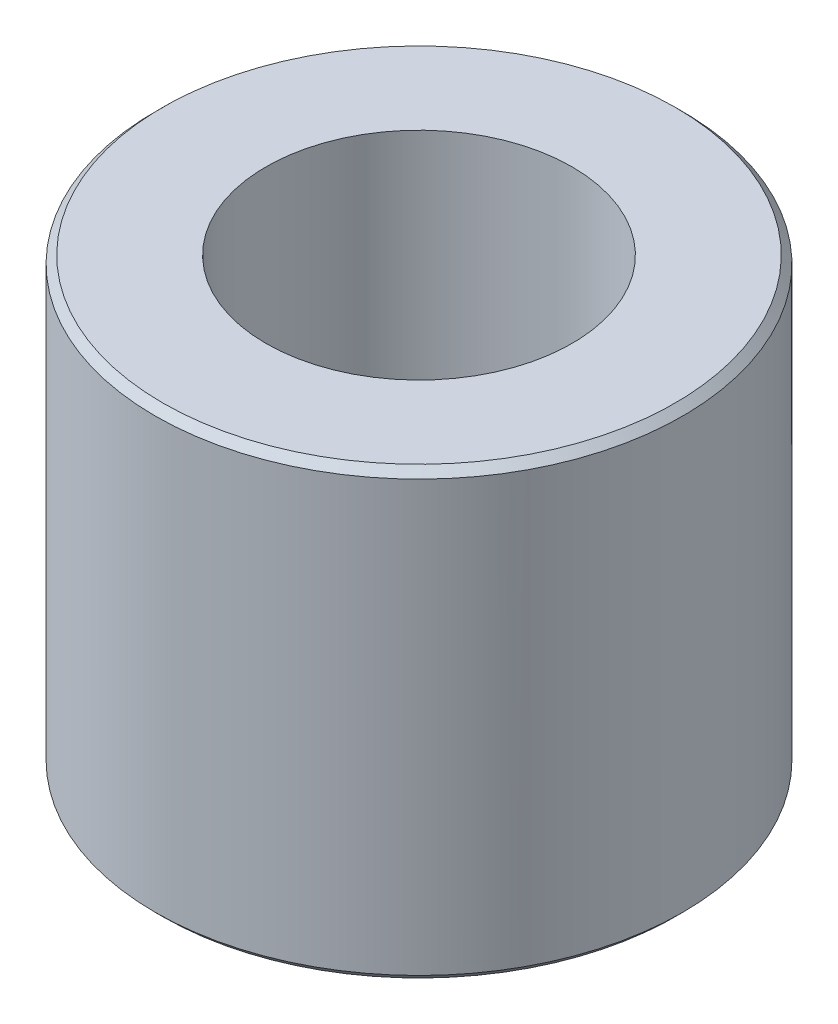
ISO-10303-21;
HEADER;
FILE_DESCRIPTION(('STEP AP214'),'2;1');
FILE_NAME('part.step','',(''),(''),'','','');
FILE_SCHEMA(('AUTOMOTIVE_DESIGN { 1 0 10303 214 1 1 1 1 }'));
ENDSEC;
DATA;
#1=APPLICATION_CONTEXT('core data for automotive mechanical design processes');
#2=APPLICATION_PROTOCOL_DEFINITION('international standard','automotive_design',2000,#1);
#3=PRODUCT_CONTEXT('',#1,'mechanical');
#4=PRODUCT('Part','Part','',(#3));
#5=PRODUCT_RELATED_PRODUCT_CATEGORY('part','',(#4));
#6=PRODUCT_DEFINITION_FORMATION('','',#4);
#7=PRODUCT_DEFINITION_CONTEXT('part definition',#1,'design');
#8=PRODUCT_DEFINITION('design','',#6,#7);
#9=PRODUCT_DEFINITION_SHAPE('','',#8);
#10=(LENGTH_UNIT() NAMED_UNIT(*) SI_UNIT(.MILLI.,.METRE.));
#11=(NAMED_UNIT(*) PLANE_ANGLE_UNIT() SI_UNIT($,.RADIAN.));
#12=(NAMED_UNIT(*) SI_UNIT($,.STERADIAN.) SOLID_ANGLE_UNIT());
#13=UNCERTAINTY_MEASURE_WITH_UNIT(LENGTH_MEASURE(1.E-05),#10,'distance_accuracy_value','');
#14=(GEOMETRIC_REPRESENTATION_CONTEXT(3) GLOBAL_UNCERTAINTY_ASSIGNED_CONTEXT((#13)) GLOBAL_UNIT_ASSIGNED_CONTEXT((#10,
#11,#12)) REPRESENTATION_CONTEXT('',''));
#15=CARTESIAN_POINT('',(0.,0.,0.));
#16=DIRECTION('',(0.,0.,1.));
#17=DIRECTION('',(1.,0.,0.));
#18=AXIS2_PLACEMENT_3D('',#15,#16,#17);
#19=CARTESIAN_POINT('',(0.,4.86357961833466,0.));
#20=DIRECTION('',(0.,1.,0.));
#21=DIRECTION('',(0.,0.,1.));
#22=AXIS2_PLACEMENT_3D('',#19,#20,#21);
#23=CYLINDRICAL_SURFACE('',#22,11.1125);
#24=CARTESIAN_POINT('',(0.,-16.0274,0.));
#25=DIRECTION('',(0.,1.,0.));
#26=DIRECTION('',(0.,0.,1.));
#27=AXIS2_PLACEMENT_3D('',#24,#25,#26);
#28=CIRCLE('',#27,11.1125);
#29=CARTESIAN_POINT('',(0.,-16.0274,11.1125));
#30=VERTEX_POINT('',#29);
#31=EDGE_CURVE('E206',#30,#30,#28,.T.);
#32=ORIENTED_EDGE('',*,*,#31,.T.);
#33=EDGE_LOOP('',(#32));
#34=FACE_BOUND('',#33,.T.);
#35=CARTESIAN_POINT('',(0.,-17.2974,0.));
#36=DIRECTION('',(0.,-1.,0.));
#37=DIRECTION('',(0.,0.,-1.));
#38=AXIS2_PLACEMENT_3D('',#35,#36,#37);
#39=CIRCLE('',#38,11.1125);
#40=CARTESIAN_POINT('',(0.,-17.2974,-11.1125));
#41=VERTEX_POINT('',#40);
#42=CARTESIAN_POINT('',(-9.62370729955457,-17.2974,-5.55625));
#43=VERTEX_POINT('',#42);
#44=EDGE_CURVE('E275',#41,#43,#39,.F.);
#45=ORIENTED_EDGE('',*,*,#44,.F.);
#46=CARTESIAN_POINT('',(9.62370729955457,-17.2974,-5.55624999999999));
#47=VERTEX_POINT('',#46);
#48=EDGE_CURVE('E53',#47,#41,#39,.F.);
#49=ORIENTED_EDGE('',*,*,#48,.F.);
#50=CARTESIAN_POINT('',(9.62370729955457,-17.2974,5.55625));
#51=VERTEX_POINT('',#50);
#52=EDGE_CURVE('E146',#51,#47,#39,.F.);
#53=ORIENTED_EDGE('',*,*,#52,.F.);
#54=CARTESIAN_POINT('',(0.,-17.2974,11.1125));
#55=VERTEX_POINT('',#54);
#56=EDGE_CURVE('E334',#55,#51,#39,.F.);
#57=ORIENTED_EDGE('',*,*,#56,.F.);
#58=CARTESIAN_POINT('',(-9.62370729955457,-17.2974,5.55624999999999));
#59=VERTEX_POINT('',#58);
#60=EDGE_CURVE('E331',#59,#55,#39,.F.);
#61=ORIENTED_EDGE('',*,*,#60,.F.);
#62=EDGE_CURVE('E328',#43,#59,#39,.F.);
#63=ORIENTED_EDGE('',*,*,#62,.F.);
#64=EDGE_LOOP('',(#45,#49,#53,#57,#61,#63));
#65=FACE_BOUND('',#64,.T.);
#66=ADVANCED_FACE('F34',(#34,#65),#23,.F.);
#67=CARTESIAN_POINT('',(0.,-29.9974,0.));
#68=DIRECTION('',(0.,-1.,0.));
#69=DIRECTION('',(0.,0.,-1.));
#70=AXIS2_PLACEMENT_3D('',#67,#68,#69);
#71=CONICAL_SURFACE('',#70,12.7635,0.785398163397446);
#72=CARTESIAN_POINT('',(6.48426541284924,-29.9976,-10.9939228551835));
#73=CARTESIAN_POINT('',(6.59253971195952,-29.8910895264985,-10.8063862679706));
#74=CARTESIAN_POINT('',(6.70165193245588,-29.787898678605,-10.6173983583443));
#75=CARTESIAN_POINT('',(6.92167256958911,-29.5891803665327,-10.2363114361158));
#76=CARTESIAN_POINT('',(7.0325818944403,-29.4936569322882,-10.0442108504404));
#77=CARTESIAN_POINT('',(7.25680524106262,-29.3109211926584,-9.65584462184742));
#78=CARTESIAN_POINT('',(7.37012898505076,-29.2237563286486,-9.45956213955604));
#79=CARTESIAN_POINT('',(7.59858968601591,-29.0595760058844,-9.0638565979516));
#80=CARTESIAN_POINT('',(7.71372637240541,-28.9825590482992,-8.86443400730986));
#81=CARTESIAN_POINT('',(7.9440420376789,-28.8410293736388,-8.46551557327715));
#82=CARTESIAN_POINT('',(8.059194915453,-28.7763477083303,-8.26606493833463));
#83=CARTESIAN_POINT('',(8.29105896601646,-28.6593600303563,-7.86446462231));
#84=CARTESIAN_POINT('',(8.4077699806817,-28.6070527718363,-7.66231521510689));
#85=CARTESIAN_POINT('',(8.64226768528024,-28.5160884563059,-7.25615327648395));
#86=CARTESIAN_POINT('',(8.76005154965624,-28.4774025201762,-7.0521456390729));
#87=CARTESIAN_POINT('',(8.99656380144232,-28.4145040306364,-6.64249440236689));
#88=CARTESIAN_POINT('',(9.11529205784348,-28.3902895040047,-6.43685102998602));
#89=CARTESIAN_POINT('',(9.40805409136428,-28.349375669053,-5.92977231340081));
#90=CARTESIAN_POINT('',(9.58240923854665,-28.3412550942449,-5.6277803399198));
#91=CARTESIAN_POINT('',(9.93076369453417,-28.3578996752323,-5.02441272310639));
#92=CARTESIAN_POINT('',(10.1047628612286,-28.3826760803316,-4.72303732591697));
#93=CARTESIAN_POINT('',(10.4510766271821,-28.4636521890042,-4.12320428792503));
#94=CARTESIAN_POINT('',(10.6233892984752,-28.5198843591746,-3.82474998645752));
#95=CARTESIAN_POINT('',(10.965036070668,-28.6607303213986,-3.23300041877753));
#96=CARTESIAN_POINT('',(11.1343704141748,-28.7453417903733,-2.93970473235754));
#97=CARTESIAN_POINT('',(11.4280771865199,-28.9151765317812,-2.43098968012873));
#98=CARTESIAN_POINT('',(11.5532320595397,-28.9950951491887,-2.21421508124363));
#99=CARTESIAN_POINT('',(11.8014107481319,-29.1671750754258,-1.78435698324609));
#100=CARTESIAN_POINT('',(11.9244346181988,-29.2593360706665,-1.57127338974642));
#101=CARTESIAN_POINT('',(12.1679537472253,-29.4539935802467,-1.14948588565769));
#102=CARTESIAN_POINT('',(12.2884557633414,-29.5564565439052,-0.940770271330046));
#103=CARTESIAN_POINT('',(12.5273499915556,-29.7705177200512,-0.526993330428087));
#104=CARTESIAN_POINT('',(12.6457431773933,-29.8821115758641,-0.321930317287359));
#105=CARTESIAN_POINT('',(12.7631491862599,-29.9976,-0.118577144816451));
#106=B_SPLINE_CURVE_WITH_KNOTS('',3,(#72,#73,#74,#75,#76,#77,#78,#79,#80,#81,#82,#83,#84,#85,
#86,#87,#88,#89,#90,#91,#92,#93,#94,#95,#96,#97,#98,#99,#100,#101,#102,#103,#104,#105),
.UNSPECIFIED.,.F.,.F.,(4,2,2,2,2,2,2,2,2,2,2,2,2,2,2,2,4),(0.,0.72400407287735,1.44838621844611,
2.17666264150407,2.90483137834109,3.62216939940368,4.3394351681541,5.05517094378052,
5.77080910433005,6.81559131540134,7.86073088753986,8.9069511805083,9.95308585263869,
10.7410355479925,11.5289650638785,12.3144068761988,13.0994760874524),.UNSPECIFIED.);
#107=CARTESIAN_POINT('',(6.48446869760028,-29.9974,-10.9935707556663));
#108=VERTEX_POINT('',#107);
#109=CARTESIAN_POINT('',(12.7629459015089,-29.9974,-0.118929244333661));
#110=VERTEX_POINT('',#109);
#111=EDGE_CURVE('E262',#108,#110,#106,.T.);
#112=ORIENTED_EDGE('',*,*,#111,.F.);
#113=CARTESIAN_POINT('',(0.,-29.9974,0.));
#114=DIRECTION('',(0.,-1.,0.));
#115=DIRECTION('',(0.,0.,-1.));
#116=AXIS2_PLACEMENT_3D('',#113,#114,#115);
#117=CIRCLE('',#116,12.7635);
#118=EDGE_CURVE('E229',#110,#108,#117,.F.);
#119=ORIENTED_EDGE('',*,*,#118,.F.);
#120=EDGE_LOOP('',(#112,#119));
#121=FACE_BOUND('',#120,.T.);
#122=ADVANCED_FACE('F316',(#121),#71,.F.);
#123=CARTESIAN_POINT('',(-13.3617774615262,-34.6127593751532,-11.1125));
#124=CARTESIAN_POINT('',(-13.0388569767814,-34.3645369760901,-11.1125));
#125=CARTESIAN_POINT('',(-12.7141934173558,-34.1185465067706,-11.1125));
#126=CARTESIAN_POINT('',(-12.0606688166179,-33.6320481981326,-11.1125));
#127=CARTESIAN_POINT('',(-11.731806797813,-33.3915416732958,-11.1125));
#128=CARTESIAN_POINT('',(-11.0667704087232,-32.9153183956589,-11.1125));
#129=CARTESIAN_POINT('',(-10.7305591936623,-32.6796529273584,-11.1125));
#130=CARTESIAN_POINT('',(-10.0525358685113,-32.2165493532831,-11.1125));
#131=CARTESIAN_POINT('',(-9.71072414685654,-31.9891106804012,-11.1125));
#132=CARTESIAN_POINT('',(-8.99877913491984,-31.5302960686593,-11.1125));
#133=CARTESIAN_POINT('',(-8.6282199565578,-31.2995776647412,-11.1125));
#134=CARTESIAN_POINT('',(-7.8784014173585,-30.852498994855,-11.1125));
#135=CARTESIAN_POINT('',(-7.49914061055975,-30.6361411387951,-11.1125));
#136=CARTESIAN_POINT('',(-6.7318213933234,-30.2223940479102,-11.1125));
#137=CARTESIAN_POINT('',(-6.34379324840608,-30.0249491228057,-11.1125));
#138=CARTESIAN_POINT('',(-5.55678484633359,-29.653451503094,-11.1125));
#139=CARTESIAN_POINT('',(-5.15780985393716,-29.4793877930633,-11.1125));
#140=CARTESIAN_POINT('',(-4.38768242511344,-29.1765435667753,-11.1125));
#141=CARTESIAN_POINT('',(-4.01762828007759,-29.0449985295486,-11.1125));
#142=CARTESIAN_POINT('',(-3.26811559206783,-28.8115314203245,-11.1125));
#143=CARTESIAN_POINT('',(-2.88865644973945,-28.7096112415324,-11.1125));
#144=CARTESIAN_POINT('',(-2.12919482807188,-28.5426000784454,-11.1125));
#145=CARTESIAN_POINT('',(-1.74934156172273,-28.4768419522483,-11.1125));
#146=CARTESIAN_POINT('',(-0.984945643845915,-28.3835226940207,-11.1125));
#147=CARTESIAN_POINT('',(-0.600403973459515,-28.3559537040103,-11.1125));
#148=CARTESIAN_POINT('',(0.152776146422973,-28.3413474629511,-11.1125));
#149=CARTESIAN_POINT('',(0.521381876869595,-28.3526060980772,-11.1125));
#150=CARTESIAN_POINT('',(1.25570457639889,-28.411127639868,-11.1125));
#151=CARTESIAN_POINT('',(1.62142127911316,-28.4583938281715,-11.1125));
#152=CARTESIAN_POINT('',(2.35351621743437,-28.5870656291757,-11.1125));
#153=CARTESIAN_POINT('',(2.71978689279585,-28.6690729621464,-11.1125));
#154=CARTESIAN_POINT('',(3.44426670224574,-28.8626855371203,-11.1125));
#155=CARTESIAN_POINT('',(3.80247630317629,-28.9742890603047,-11.1125));
#156=CARTESIAN_POINT('',(4.5311079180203,-29.2295353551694,-11.1125));
#157=CARTESIAN_POINT('',(4.90099621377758,-29.3746845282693,-11.1125));
#158=CARTESIAN_POINT('',(5.63125512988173,-29.6874022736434,-11.1125));
#159=CARTESIAN_POINT('',(5.99162136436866,-29.8549809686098,-11.1125));
#160=CARTESIAN_POINT('',(6.7045403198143,-30.2085832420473,-11.1125));
#161=CARTESIAN_POINT('',(7.05706460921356,-30.3946636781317,-11.1125));
#162=CARTESIAN_POINT('',(7.75403395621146,-30.7811737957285,-11.1125));
#163=CARTESIAN_POINT('',(8.0984802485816,-30.9816012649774,-11.1125));
#164=CARTESIAN_POINT('',(8.76351153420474,-31.3838188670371,-11.1125));
#165=CARTESIAN_POINT('',(9.08443476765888,-31.5850527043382,-11.1125));
#166=CARTESIAN_POINT('',(9.72076766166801,-31.9960820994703,-11.1125));
#167=CARTESIAN_POINT('',(10.0361769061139,-32.2058782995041,-11.1125));
#168=CARTESIAN_POINT('',(10.6596664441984,-32.6307964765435,-11.1125));
#169=CARTESIAN_POINT('',(10.9677852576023,-32.84586213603,-11.1125));
#170=CARTESIAN_POINT('',(11.5797964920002,-33.2817557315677,-11.1125));
#171=CARTESIAN_POINT('',(11.8836900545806,-33.502582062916,-11.1125));
#172=CARTESIAN_POINT('',(12.1858113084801,-33.7257662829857,-11.1125));
#173=B_SPLINE_CURVE_WITH_KNOTS('',3,(#123,#124,#125,#126,#127,#128,#129,#130,#131,#132,#133,
#134,#135,#136,#137,#138,#139,#140,#141,#142,#143,#144,#145,#146,#147,#148,#149,#150,#151,#152,
#153,#154,#155,#156,#157,#158,#159,#160,#161,#162,#163,#164,#165,#166,#167,#168,#169,#170,#171,
#172),.UNSPECIFIED.,.F.,.F.,(4,2,2,2,2,2,2,2,2,2,2,2,2,2,2,2,2,2,2,2,2,2,2,2,4),(0.,
1.22191774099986,2.44412535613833,3.67576462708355,4.90731883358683,6.21660421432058,
7.52610875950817,8.83163054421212,10.1365350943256,11.313736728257,12.4910135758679,
13.6457727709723,14.8002943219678,15.9048015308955,17.0094094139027,18.1339862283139,
19.2584977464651,20.4496286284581,21.6412989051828,22.8367516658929,24.0320204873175,
25.1682506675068,26.3045662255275,27.4317540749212,28.5586312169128),.UNSPECIFIED.);
#174=CARTESIAN_POINT('',(-6.27847720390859,-29.9974,-11.1125));
#175=VERTEX_POINT('',#174);
#176=CARTESIAN_POINT('',(6.27847720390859,-29.9974,-11.1125));
#177=VERTEX_POINT('',#176);
#178=EDGE_CURVE('E268',#175,#177,#173,.T.);
#179=ORIENTED_EDGE('',*,*,#178,.F.);
#180=EDGE_CURVE('E224',#177,#175,#117,.F.);
#181=ORIENTED_EDGE('',*,*,#180,.F.);
#182=EDGE_LOOP('',(#179,#181));
#183=FACE_BOUND('',#182,.T.);
#184=ADVANCED_FACE('F321',(#183),#71,.F.);
#185=CARTESIAN_POINT('',(-12.7631491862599,-29.9976,-0.118577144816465));
#186=CARTESIAN_POINT('',(-12.6548748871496,-29.8910895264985,-0.306113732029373));
#187=CARTESIAN_POINT('',(-12.5457626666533,-29.787898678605,-0.495101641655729));
#188=CARTESIAN_POINT('',(-12.32574202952,-29.5891803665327,-0.876188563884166));
#189=CARTESIAN_POINT('',(-12.2148327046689,-29.4936569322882,-1.06828914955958));
#190=CARTESIAN_POINT('',(-11.9906093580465,-29.3109211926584,-1.45665537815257));
#191=CARTESIAN_POINT('',(-11.8772856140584,-29.2237563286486,-1.65293786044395));
#192=CARTESIAN_POINT('',(-11.6488249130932,-29.0595760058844,-2.04864340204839));
#193=CARTESIAN_POINT('',(-11.5336882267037,-28.9825590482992,-2.24806599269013));
#194=CARTESIAN_POINT('',(-11.3033725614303,-28.8410293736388,-2.64698442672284));
#195=CARTESIAN_POINT('',(-11.1882196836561,-28.7763477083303,-2.84643506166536));
#196=CARTESIAN_POINT('',(-10.9563556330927,-28.6593600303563,-3.24803537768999));
#197=CARTESIAN_POINT('',(-10.8396446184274,-28.6070527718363,-3.4501847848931));
#198=CARTESIAN_POINT('',(-10.6051469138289,-28.5160884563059,-3.85634672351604));
#199=CARTESIAN_POINT('',(-10.4873630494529,-28.4774025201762,-4.06035436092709));
#200=CARTESIAN_POINT('',(-10.2508507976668,-28.4145040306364,-4.4700055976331));
#201=CARTESIAN_POINT('',(-10.1321225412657,-28.3902895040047,-4.67564897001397));
#202=CARTESIAN_POINT('',(-9.83936050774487,-28.349375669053,-5.18272768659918));
#203=CARTESIAN_POINT('',(-9.6650053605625,-28.3412550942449,-5.48471966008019));
#204=CARTESIAN_POINT('',(-9.31665090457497,-28.3578996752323,-6.0880872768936));
#205=CARTESIAN_POINT('',(-9.14265173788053,-28.3826760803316,-6.38946267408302));
#206=CARTESIAN_POINT('',(-8.79633797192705,-28.4636521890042,-6.98929571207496));
#207=CARTESIAN_POINT('',(-8.62402530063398,-28.5198843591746,-7.28775001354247));
#208=CARTESIAN_POINT('',(-8.2823785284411,-28.6607303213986,-7.87949958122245));
#209=CARTESIAN_POINT('',(-8.11304418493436,-28.7453417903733,-8.17279526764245));
#210=CARTESIAN_POINT('',(-7.81933741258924,-28.9151765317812,-8.68151031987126));
#211=CARTESIAN_POINT('',(-7.69418253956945,-28.9950951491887,-8.89828491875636));
#212=CARTESIAN_POINT('',(-7.44600385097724,-29.1671750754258,-9.32814301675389));
#213=CARTESIAN_POINT('',(-7.32297998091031,-29.2593360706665,-9.54122661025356));
#214=CARTESIAN_POINT('',(-7.07946085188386,-29.4539935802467,-9.9630141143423));
#215=CARTESIAN_POINT('',(-6.95895883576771,-29.5564565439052,-10.1717297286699));
#216=CARTESIAN_POINT('',(-6.72006460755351,-29.7705177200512,-10.5855066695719));
#217=CARTESIAN_POINT('',(-6.60167142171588,-29.8821115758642,-10.7905696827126));
#218=CARTESIAN_POINT('',(-6.48426541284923,-29.9976,-10.9939228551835));
#219=B_SPLINE_CURVE_WITH_KNOTS('',3,(#185,#186,#187,#188,#189,#190,#191,#192,#193,#194,#195,
#196,#197,#198,#199,#200,#201,#202,#203,#204,#205,#206,#207,#208,#209,#210,#211,#212,#213,#214,
#215,#216,#217,#218),.UNSPECIFIED.,.F.,.F.,(4,2,2,2,2,2,2,2,2,2,2,2,2,2,2,2,4),(0.,
0.724004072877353,1.44838621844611,2.17666264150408,2.90483137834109,3.62216939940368,
4.33943516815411,5.05517094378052,5.77080910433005,6.81559131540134,7.86073088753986,
8.9069511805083,9.95308585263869,10.7410355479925,11.5289650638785,12.3144068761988,
13.0994760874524),.UNSPECIFIED.);
#220=CARTESIAN_POINT('',(-12.7629459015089,-29.9974,-0.118929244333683));
#221=VERTEX_POINT('',#220);
#222=CARTESIAN_POINT('',(-6.48446869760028,-29.9974,-10.9935707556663));
#223=VERTEX_POINT('',#222);
#224=EDGE_CURVE('E401',#221,#223,#219,.T.);
#225=ORIENTED_EDGE('',*,*,#224,.F.);
#226=EDGE_CURVE('E230',#223,#221,#117,.F.);
#227=ORIENTED_EDGE('',*,*,#226,.F.);
#228=EDGE_LOOP('',(#225,#227));
#229=FACE_BOUND('',#228,.T.);
#230=ADVANCED_FACE('F382',(#229),#71,.F.);
#231=CARTESIAN_POINT('',(-6.48426541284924,-29.9976,10.9939228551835));
#232=CARTESIAN_POINT('',(-6.59253971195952,-29.8910895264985,10.8063862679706));
#233=CARTESIAN_POINT('',(-6.70165193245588,-29.787898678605,10.6173983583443));
#234=CARTESIAN_POINT('',(-6.92167256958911,-29.5891803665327,10.2363114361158));
#235=CARTESIAN_POINT('',(-7.0325818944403,-29.4936569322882,10.0442108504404));
#236=CARTESIAN_POINT('',(-7.25680524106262,-29.3109211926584,9.65584462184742));
#237=CARTESIAN_POINT('',(-7.37012898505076,-29.2237563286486,9.45956213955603));
#238=CARTESIAN_POINT('',(-7.59858968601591,-29.0595760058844,9.06385659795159));
#239=CARTESIAN_POINT('',(-7.71372637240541,-28.9825590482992,8.86443400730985));
#240=CARTESIAN_POINT('',(-7.9440420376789,-28.8410293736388,8.46551557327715));
#241=CARTESIAN_POINT('',(-8.05919491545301,-28.7763477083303,8.26606493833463));
#242=CARTESIAN_POINT('',(-8.29105896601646,-28.6593600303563,7.86446462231));
#243=CARTESIAN_POINT('',(-8.4077699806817,-28.6070527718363,7.66231521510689));
#244=CARTESIAN_POINT('',(-8.64226768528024,-28.5160884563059,7.25615327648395));
#245=CARTESIAN_POINT('',(-8.76005154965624,-28.4774025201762,7.0521456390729));
#246=CARTESIAN_POINT('',(-8.99656380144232,-28.4145040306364,6.64249440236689));
#247=CARTESIAN_POINT('',(-9.11529205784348,-28.3902895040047,6.43685102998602));
#248=CARTESIAN_POINT('',(-9.40805409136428,-28.349375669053,5.92977231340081));
#249=CARTESIAN_POINT('',(-9.58240923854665,-28.3412550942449,5.62778033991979));
#250=CARTESIAN_POINT('',(-9.93076369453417,-28.3578996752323,5.02441272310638));
#251=CARTESIAN_POINT('',(-10.1047628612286,-28.3826760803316,4.72303732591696));
#252=CARTESIAN_POINT('',(-10.4510766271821,-28.4636521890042,4.12320428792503));
#253=CARTESIAN_POINT('',(-10.6233892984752,-28.5198843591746,3.82474998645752));
#254=CARTESIAN_POINT('',(-10.965036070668,-28.6607303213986,3.23300041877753));
#255=CARTESIAN_POINT('',(-11.1343704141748,-28.7453417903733,2.93970473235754));
#256=CARTESIAN_POINT('',(-11.4280771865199,-28.9151765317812,2.43098968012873));
#257=CARTESIAN_POINT('',(-11.5532320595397,-28.9950951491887,2.21421508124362));
#258=CARTESIAN_POINT('',(-11.8014107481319,-29.1671750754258,1.78435698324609));
#259=CARTESIAN_POINT('',(-11.9244346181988,-29.2593360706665,1.57127338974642));
#260=CARTESIAN_POINT('',(-12.1679537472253,-29.4539935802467,1.14948588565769));
#261=CARTESIAN_POINT('',(-12.2884557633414,-29.5564565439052,0.940770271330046));
#262=CARTESIAN_POINT('',(-12.5273499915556,-29.7705177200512,0.526993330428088));
#263=CARTESIAN_POINT('',(-12.6457431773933,-29.8821115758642,0.321930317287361));
#264=CARTESIAN_POINT('',(-12.7631491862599,-29.9976,0.118577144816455));
#265=B_SPLINE_CURVE_WITH_KNOTS('',3,(#231,#232,#233,#234,#235,#236,#237,#238,#239,#240,#241,
#242,#243,#244,#245,#246,#247,#248,#249,#250,#251,#252,#253,#254,#255,#256,#257,#258,#259,#260,
#261,#262,#263,#264),.UNSPECIFIED.,.F.,.F.,(4,2,2,2,2,2,2,2,2,2,2,2,2,2,2,2,4),(0.,
0.72400407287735,1.44838621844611,2.17666264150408,2.90483137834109,3.62216939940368,
4.3394351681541,5.05517094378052,5.77080910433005,6.81559131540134,7.86073088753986,
8.9069511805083,9.9530858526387,10.7410355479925,11.5289650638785,12.3144068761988,
13.0994760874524),.UNSPECIFIED.);
#266=CARTESIAN_POINT('',(-6.48446869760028,-29.9974,10.9935707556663));
#267=VERTEX_POINT('',#266);
#268=CARTESIAN_POINT('',(-12.7629459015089,-29.9974,0.118929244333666));
#269=VERTEX_POINT('',#268);
#270=EDGE_CURVE('E388',#267,#269,#265,.T.);
#271=ORIENTED_EDGE('',*,*,#270,.F.);
#272=EDGE_CURVE('E391',#269,#267,#117,.F.);
#273=ORIENTED_EDGE('',*,*,#272,.F.);
#274=EDGE_LOOP('',(#271,#273));
#275=FACE_BOUND('',#274,.T.);
#276=ADVANCED_FACE('F376',(#275),#71,.F.);
#277=CARTESIAN_POINT('',(-13.3617774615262,-34.6127593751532,11.1125));
#278=CARTESIAN_POINT('',(-13.0388569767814,-34.3645369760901,11.1125));
#279=CARTESIAN_POINT('',(-12.7141934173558,-34.1185465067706,11.1125));
#280=CARTESIAN_POINT('',(-12.0606688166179,-33.6320481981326,11.1125));
#281=CARTESIAN_POINT('',(-11.731806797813,-33.3915416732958,11.1125));
#282=CARTESIAN_POINT('',(-11.0667704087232,-32.9153183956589,11.1125));
#283=CARTESIAN_POINT('',(-10.7305591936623,-32.6796529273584,11.1125));
#284=CARTESIAN_POINT('',(-10.0525358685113,-32.2165493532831,11.1125));
#285=CARTESIAN_POINT('',(-9.71072414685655,-31.9891106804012,11.1125));
#286=CARTESIAN_POINT('',(-8.99877913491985,-31.5302960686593,11.1125));
#287=CARTESIAN_POINT('',(-8.62821995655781,-31.2995776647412,11.1125));
#288=CARTESIAN_POINT('',(-7.87840141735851,-30.852498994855,11.1125));
#289=CARTESIAN_POINT('',(-7.49914061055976,-30.6361411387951,11.1125));
#290=CARTESIAN_POINT('',(-6.73182139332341,-30.2223940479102,11.1125));
#291=CARTESIAN_POINT('',(-6.34379324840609,-30.0249491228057,11.1125));
#292=CARTESIAN_POINT('',(-5.5567848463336,-29.653451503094,11.1125));
#293=CARTESIAN_POINT('',(-5.15780985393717,-29.4793877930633,11.1125));
#294=CARTESIAN_POINT('',(-4.38768242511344,-29.1765435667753,11.1125));
#295=CARTESIAN_POINT('',(-4.01762828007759,-29.0449985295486,11.1125));
#296=CARTESIAN_POINT('',(-3.26811559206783,-28.8115314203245,11.1125));
#297=CARTESIAN_POINT('',(-2.88865644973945,-28.7096112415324,11.1125));
#298=CARTESIAN_POINT('',(-2.12919482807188,-28.5426000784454,11.1125));
#299=CARTESIAN_POINT('',(-1.74934156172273,-28.4768419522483,11.1125));
#300=CARTESIAN_POINT('',(-0.984945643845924,-28.3835226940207,11.1125));
#301=CARTESIAN_POINT('',(-0.600403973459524,-28.3559537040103,11.1125));
#302=CARTESIAN_POINT('',(0.152776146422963,-28.3413474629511,11.1125));
#303=CARTESIAN_POINT('',(0.521381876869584,-28.3526060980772,11.1125));
#304=CARTESIAN_POINT('',(1.25570457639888,-28.411127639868,11.1125));
#305=CARTESIAN_POINT('',(1.62142127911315,-28.4583938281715,11.1125));
#306=CARTESIAN_POINT('',(2.35351621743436,-28.5870656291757,11.1125));
#307=CARTESIAN_POINT('',(2.71978689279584,-28.6690729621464,11.1125));
#308=CARTESIAN_POINT('',(3.44426670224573,-28.8626855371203,11.1125));
#309=CARTESIAN_POINT('',(3.80247630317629,-28.9742890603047,11.1125));
#310=CARTESIAN_POINT('',(4.5311079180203,-29.2295353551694,11.1125));
#311=CARTESIAN_POINT('',(4.90099621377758,-29.3746845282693,11.1125));
#312=CARTESIAN_POINT('',(5.63125512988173,-29.6874022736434,11.1125));
#313=CARTESIAN_POINT('',(5.99162136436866,-29.8549809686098,11.1125));
#314=CARTESIAN_POINT('',(6.70454031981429,-30.2085832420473,11.1125));
#315=CARTESIAN_POINT('',(7.05706460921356,-30.3946636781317,11.1125));
#316=CARTESIAN_POINT('',(7.75403395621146,-30.7811737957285,11.1125));
#317=CARTESIAN_POINT('',(8.0984802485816,-30.9816012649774,11.1125));
#318=CARTESIAN_POINT('',(8.76351153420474,-31.3838188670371,11.1125));
#319=CARTESIAN_POINT('',(9.08443476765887,-31.5850527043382,11.1125));
#320=CARTESIAN_POINT('',(9.720767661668,-31.9960820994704,11.1125));
#321=CARTESIAN_POINT('',(10.0361769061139,-32.2058782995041,11.1125));
#322=CARTESIAN_POINT('',(10.6596664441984,-32.6307964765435,11.1125));
#323=CARTESIAN_POINT('',(10.9677852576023,-32.84586213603,11.1125));
#324=CARTESIAN_POINT('',(11.5797964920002,-33.2817557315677,11.1125));
#325=CARTESIAN_POINT('',(11.8836900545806,-33.502582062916,11.1125));
#326=CARTESIAN_POINT('',(12.18581130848,-33.7257662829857,11.1125));
#327=B_SPLINE_CURVE_WITH_KNOTS('',3,(#277,#278,#279,#280,#281,#282,#283,#284,#285,#286,#287,
#288,#289,#290,#291,#292,#293,#294,#295,#296,#297,#298,#299,#300,#301,#302,#303,#304,#305,#306,
#307,#308,#309,#310,#311,#312,#313,#314,#315,#316,#317,#318,#319,#320,#321,#322,#323,#324,#325,
#326),.UNSPECIFIED.,.F.,.F.,(4,2,2,2,2,2,2,2,2,2,2,2,2,2,2,2,2,2,2,2,2,2,2,2,4),(0.,
1.22191774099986,2.44412535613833,3.67576462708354,4.90731883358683,6.21660421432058,
7.52610875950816,8.83163054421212,10.1365350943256,11.313736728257,12.4910135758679,
13.6457727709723,14.8002943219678,15.9048015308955,17.0094094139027,18.1339862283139,
19.2584977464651,20.4496286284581,21.6412989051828,22.8367516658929,24.0320204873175,
25.1682506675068,26.3045662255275,27.4317540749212,28.5586312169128),.UNSPECIFIED.);
#328=CARTESIAN_POINT('',(6.27847720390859,-29.9974,11.1125));
#329=VERTEX_POINT('',#328);
#330=CARTESIAN_POINT('',(-6.27847720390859,-29.9974,11.1125));
#331=VERTEX_POINT('',#330);
#332=EDGE_CURVE('E238',#329,#331,#327,.F.);
#333=ORIENTED_EDGE('',*,*,#332,.F.);
#334=EDGE_CURVE('E386',#331,#329,#117,.F.);
#335=ORIENTED_EDGE('',*,*,#334,.F.);
#336=EDGE_LOOP('',(#333,#335));
#337=FACE_BOUND('',#336,.T.);
#338=ADVANCED_FACE('F372',(#337),#71,.F.);
#339=CARTESIAN_POINT('',(0.,-29.9974,0.));
#340=DIRECTION('',(0.,-1.,0.));
#341=DIRECTION('',(0.,0.,-1.));
#342=AXIS2_PLACEMENT_3D('',#339,#340,#341);
#343=PLANE('',#342);
#344=CARTESIAN_POINT('',(0.,-29.9974,0.));
#345=DIRECTION('',(0.,-1.,0.));
#346=DIRECTION('',(0.,0.,-1.));
#347=AXIS2_PLACEMENT_3D('',#344,#345,#346);
#348=CIRCLE('',#347,17.272);
#349=CARTESIAN_POINT('',(0.,-29.9974,-17.272));
#350=VERTEX_POINT('',#349);
#351=EDGE_CURVE('E42',#350,#350,#348,.T.);
#352=ORIENTED_EDGE('',*,*,#351,.T.);
#353=EDGE_LOOP('',(#352));
#354=FACE_BOUND('',#353,.T.);
#355=DIRECTION('',(0.499999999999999,0.,0.866025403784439));
#356=VECTOR('',#355,1.);
#357=CARTESIAN_POINT('',(6.41580486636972,-29.9974,-11.1125));
#358=LINE('',#357,#356);
#359=CARTESIAN_POINT('',(6.41580486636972,-29.9974,-11.1125));
#360=VERTEX_POINT('',#359);
#361=EDGE_CURVE('E182',#360,#108,#358,.T.);
#362=ORIENTED_EDGE('',*,*,#361,.F.);
#363=DIRECTION('',(1.,0.,0.));
#364=VECTOR('',#363,1.);
#365=CARTESIAN_POINT('',(-6.41580486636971,-29.9974,-11.1125));
#366=LINE('',#365,#364);
#367=EDGE_CURVE('E200',#177,#360,#366,.T.);
#368=ORIENTED_EDGE('',*,*,#367,.F.);
#369=ORIENTED_EDGE('',*,*,#180,.T.);
#370=CARTESIAN_POINT('',(-6.41580486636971,-29.9974,-11.1125));
#371=VERTEX_POINT('',#370);
#372=EDGE_CURVE('E148',#371,#175,#366,.T.);
#373=ORIENTED_EDGE('',*,*,#372,.F.);
#374=DIRECTION('',(0.5,0.,-0.866025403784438));
#375=VECTOR('',#374,1.);
#376=CARTESIAN_POINT('',(-12.8316097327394,-29.9974,0.));
#377=LINE('',#376,#375);
#378=EDGE_CURVE('E196',#223,#371,#377,.T.);
#379=ORIENTED_EDGE('',*,*,#378,.F.);
#380=ORIENTED_EDGE('',*,*,#226,.T.);
#381=CARTESIAN_POINT('',(-12.8316097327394,-29.9974,0.));
#382=VERTEX_POINT('',#381);
#383=EDGE_CURVE('E197',#382,#221,#377,.T.);
#384=ORIENTED_EDGE('',*,*,#383,.F.);
#385=DIRECTION('',(-0.5,0.,-0.866025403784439));
#386=VECTOR('',#385,1.);
#387=CARTESIAN_POINT('',(-6.41580486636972,-29.9974,11.1125));
#388=LINE('',#387,#386);
#389=EDGE_CURVE('E192',#269,#382,#388,.T.);
#390=ORIENTED_EDGE('',*,*,#389,.F.);
#391=ORIENTED_EDGE('',*,*,#272,.T.);
#392=CARTESIAN_POINT('',(-6.41580486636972,-29.9974,11.1125));
#393=VERTEX_POINT('',#392);
#394=EDGE_CURVE('E193',#393,#267,#388,.T.);
#395=ORIENTED_EDGE('',*,*,#394,.F.);
#396=DIRECTION('',(-1.,0.,0.));
#397=VECTOR('',#396,1.);
#398=CARTESIAN_POINT('',(6.41580486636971,-29.9974,11.1125));
#399=LINE('',#398,#397);
#400=EDGE_CURVE('E188',#331,#393,#399,.T.);
#401=ORIENTED_EDGE('',*,*,#400,.F.);
#402=ORIENTED_EDGE('',*,*,#334,.T.);
#403=CARTESIAN_POINT('',(6.41580486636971,-29.9974,11.1125));
#404=VERTEX_POINT('',#403);
#405=EDGE_CURVE('E189',#404,#329,#399,.T.);
#406=ORIENTED_EDGE('',*,*,#405,.F.);
#407=DIRECTION('',(-0.500000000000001,0.,0.866025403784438));
#408=VECTOR('',#407,1.);
#409=CARTESIAN_POINT('',(12.8316097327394,-29.9974,0.));
#410=LINE('',#409,#408);
#411=CARTESIAN_POINT('',(6.48446869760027,-29.9974,10.9935707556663));
#412=VERTEX_POINT('',#411);
#413=EDGE_CURVE('E185',#412,#404,#410,.T.);
#414=ORIENTED_EDGE('',*,*,#413,.F.);
#415=CARTESIAN_POINT('',(12.7629459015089,-29.9974,0.118929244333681));
#416=VERTEX_POINT('',#415);
#417=EDGE_CURVE('E392',#412,#416,#117,.F.);
#418=ORIENTED_EDGE('',*,*,#417,.T.);
#419=CARTESIAN_POINT('',(12.8316097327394,-29.9974,0.));
#420=VERTEX_POINT('',#419);
#421=EDGE_CURVE('E186',#420,#416,#410,.T.);
#422=ORIENTED_EDGE('',*,*,#421,.F.);
#423=EDGE_CURVE('E154',#110,#420,#358,.T.);
#424=ORIENTED_EDGE('',*,*,#423,.F.);
#425=ORIENTED_EDGE('',*,*,#118,.T.);
#426=EDGE_LOOP('',(#362,#368,#369,#373,#379,#380,#384,#390,#391,#395,#401,#402,#406,#414,#418,
#422,#424,#425));
#427=FACE_BOUND('',#426,.T.);
#428=ADVANCED_FACE('F284',(#354,#427),#343,.T.);
#429=CARTESIAN_POINT('',(0.,12.4902148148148,0.));
#430=DIRECTION('',(0.,1.,0.));
#431=DIRECTION('',(0.,0.,1.));
#432=AXIS2_PLACEMENT_3D('',#429,#430,#431);
#433=CYLINDRICAL_SURFACE('',#432,17.78);
#434=CARTESIAN_POINT('',(0.,-29.4894,0.));
#435=DIRECTION('',(0.,-1.,0.));
#436=DIRECTION('',(0.,0.,-1.));
#437=AXIS2_PLACEMENT_3D('',#434,#435,#436);
#438=CIRCLE('',#437,17.78);
#439=CARTESIAN_POINT('',(0.,-29.4894,-17.78));
#440=VERTEX_POINT('',#439);
#441=EDGE_CURVE('E279',#440,#440,#438,.F.);
#442=ORIENTED_EDGE('',*,*,#441,.T.);
#443=EDGE_LOOP('',(#442));
#444=FACE_BOUND('',#443,.T.);
#445=CARTESIAN_POINT('',(0.,-0.508000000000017,0.));
#446=DIRECTION('',(0.,1.,0.));
#447=DIRECTION('',(0.,0.,1.));
#448=AXIS2_PLACEMENT_3D('',#445,#446,#447);
#449=CIRCLE('',#448,17.78);
#450=CARTESIAN_POINT('',(0.,-0.508000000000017,17.78));
#451=VERTEX_POINT('',#450);
#452=EDGE_CURVE('E276',#451,#451,#449,.F.);
#453=ORIENTED_EDGE('',*,*,#452,.T.);
#454=EDGE_LOOP('',(#453));
#455=FACE_BOUND('',#454,.T.);
#456=ADVANCED_FACE('F291',(#444,#455),#433,.T.);
#457=CARTESIAN_POINT('',(0.,0.,0.));
#458=DIRECTION('',(0.,1.,0.));
#459=DIRECTION('',(0.,0.,1.));
#460=AXIS2_PLACEMENT_3D('',#457,#458,#459);
#461=PLANE('',#460);
#462=CARTESIAN_POINT('',(0.,0.,0.));
#463=DIRECTION('',(0.,1.,0.));
#464=DIRECTION('',(0.,0.,1.));
#465=AXIS2_PLACEMENT_3D('',#462,#463,#464);
#466=CIRCLE('',#465,17.272);
#467=CARTESIAN_POINT('',(0.,0.,17.272));
#468=VERTEX_POINT('',#467);
#469=EDGE_CURVE('E11',#468,#468,#466,.T.);
#470=ORIENTED_EDGE('',*,*,#469,.T.);
#471=EDGE_LOOP('',(#470));
#472=FACE_BOUND('',#471,.T.);
#473=CARTESIAN_POINT('',(0.,0.,0.));
#474=DIRECTION('',(0.,1.,0.));
#475=DIRECTION('',(0.,0.,1.));
#476=AXIS2_PLACEMENT_3D('',#473,#474,#475);
#477=CIRCLE('',#476,10.31875);
#478=CARTESIAN_POINT('',(0.,0.,10.31875));
#479=VERTEX_POINT('',#478);
#480=EDGE_CURVE('E221',#479,#479,#477,.T.);
#481=ORIENTED_EDGE('',*,*,#480,.F.);
#482=EDGE_LOOP('',(#481));
#483=FACE_BOUND('',#482,.T.);
#484=ADVANCED_FACE('F294',(#472,#483),#461,.T.);
#485=CARTESIAN_POINT('',(0.,0.,0.));
#486=DIRECTION('',(0.,1.,0.));
#487=DIRECTION('',(0.,0.,1.));
#488=AXIS2_PLACEMENT_3D('',#485,#486,#487);
#489=CYLINDRICAL_SURFACE('',#488,10.31875);
#490=CARTESIAN_POINT('',(0.,-15.5504668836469,0.));
#491=DIRECTION('',(0.,-1.,0.));
#492=DIRECTION('',(0.,0.,-1.));
#493=AXIS2_PLACEMENT_3D('',#490,#491,#492);
#494=CIRCLE('',#493,10.31875);
#495=CARTESIAN_POINT('',(0.,-15.5504668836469,-10.31875));
#496=VERTEX_POINT('',#495);
#497=EDGE_CURVE('E220',#496,#496,#494,.T.);
#498=ORIENTED_EDGE('',*,*,#497,.T.);
#499=EDGE_LOOP('',(#498));
#500=FACE_BOUND('',#499,.T.);
#501=ORIENTED_EDGE('',*,*,#480,.T.);
#502=EDGE_LOOP('',(#501));
#503=FACE_BOUND('',#502,.T.);
#504=ADVANCED_FACE('F304',(#500,#503),#489,.F.);
#505=CARTESIAN_POINT('',(0.,-9.35033637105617,0.));
#506=DIRECTION('',(0.,-1.,0.));
#507=DIRECTION('',(0.,0.,-1.));
#508=AXIS2_PLACEMENT_3D('',#505,#506,#507);
#509=CONICAL_SURFACE('',#508,0.,1.02974425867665);
#510=ORIENTED_EDGE('',*,*,#31,.F.);
#511=EDGE_LOOP('',(#510));
#512=FACE_BOUND('',#511,.T.);
#513=ORIENTED_EDGE('',*,*,#497,.F.);
#514=EDGE_LOOP('',(#513));
#515=FACE_BOUND('',#514,.T.);
#516=ADVANCED_FACE('F259',(#512,#515),#509,.F.);
#517=CARTESIAN_POINT('',(12.7631491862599,-29.9976,0.118577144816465));
#518=CARTESIAN_POINT('',(12.6548748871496,-29.8910895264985,0.306113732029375));
#519=CARTESIAN_POINT('',(12.5457626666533,-29.7878986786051,0.49510164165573));
#520=CARTESIAN_POINT('',(12.32574202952,-29.5891803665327,0.876188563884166));
#521=CARTESIAN_POINT('',(12.2148327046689,-29.4936569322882,1.06828914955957));
#522=CARTESIAN_POINT('',(11.9906093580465,-29.3109211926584,1.45665537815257));
#523=CARTESIAN_POINT('',(11.8772856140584,-29.2237563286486,1.65293786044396));
#524=CARTESIAN_POINT('',(11.6488249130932,-29.0595760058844,2.0486434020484));
#525=CARTESIAN_POINT('',(11.5336882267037,-28.9825590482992,2.24806599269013));
#526=CARTESIAN_POINT('',(11.3033725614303,-28.8410293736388,2.64698442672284));
#527=CARTESIAN_POINT('',(11.1882196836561,-28.7763477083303,2.84643506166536));
#528=CARTESIAN_POINT('',(10.9563556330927,-28.6593600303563,3.24803537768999));
#529=CARTESIAN_POINT('',(10.8396446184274,-28.6070527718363,3.4501847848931));
#530=CARTESIAN_POINT('',(10.6051469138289,-28.5160884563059,3.85634672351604));
#531=CARTESIAN_POINT('',(10.4873630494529,-28.4774025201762,4.06035436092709));
#532=CARTESIAN_POINT('',(10.2508507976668,-28.4145040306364,4.4700055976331));
#533=CARTESIAN_POINT('',(10.1321225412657,-28.3902895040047,4.67564897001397));
#534=CARTESIAN_POINT('',(9.83936050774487,-28.349375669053,5.18272768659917));
#535=CARTESIAN_POINT('',(9.66500536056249,-28.3412550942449,5.48471966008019));
#536=CARTESIAN_POINT('',(9.31665090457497,-28.3578996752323,6.0880872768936));
#537=CARTESIAN_POINT('',(9.14265173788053,-28.3826760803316,6.38946267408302));
#538=CARTESIAN_POINT('',(8.79633797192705,-28.4636521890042,6.98929571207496));
#539=CARTESIAN_POINT('',(8.62402530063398,-28.5198843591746,7.28775001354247));
#540=CARTESIAN_POINT('',(8.2823785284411,-28.6607303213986,7.87949958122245));
#541=CARTESIAN_POINT('',(8.11304418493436,-28.7453417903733,8.17279526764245));
#542=CARTESIAN_POINT('',(7.81933741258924,-28.9151765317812,8.68151031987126));
#543=CARTESIAN_POINT('',(7.69418253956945,-28.9950951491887,8.89828491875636));
#544=CARTESIAN_POINT('',(7.44600385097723,-29.1671750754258,9.32814301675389));
#545=CARTESIAN_POINT('',(7.32297998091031,-29.2593360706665,9.54122661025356));
#546=CARTESIAN_POINT('',(7.07946085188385,-29.4539935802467,9.9630141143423));
#547=CARTESIAN_POINT('',(6.95895883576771,-29.5564565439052,10.1717297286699));
#548=CARTESIAN_POINT('',(6.72006460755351,-29.7705177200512,10.5855066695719));
#549=CARTESIAN_POINT('',(6.60167142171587,-29.8821115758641,10.7905696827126));
#550=CARTESIAN_POINT('',(6.48426541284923,-29.9976,10.9939228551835));
#551=B_SPLINE_CURVE_WITH_KNOTS('',3,(#517,#518,#519,#520,#521,#522,#523,#524,#525,#526,#527,
#528,#529,#530,#531,#532,#533,#534,#535,#536,#537,#538,#539,#540,#541,#542,#543,#544,#545,#546,
#547,#548,#549,#550),.UNSPECIFIED.,.F.,.F.,(4,2,2,2,2,2,2,2,2,2,2,2,2,2,2,2,4),(0.,
0.724004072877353,1.44838621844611,2.17666264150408,2.90483137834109,3.62216939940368,
4.33943516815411,5.05517094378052,5.77080910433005,6.81559131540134,7.86073088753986,
8.9069511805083,9.9530858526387,10.7410355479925,11.5289650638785,12.3144068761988,
13.0994760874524),.UNSPECIFIED.);
#552=EDGE_CURVE('E231',#416,#412,#551,.T.);
#553=ORIENTED_EDGE('',*,*,#552,.F.);
#554=ORIENTED_EDGE('',*,*,#417,.F.);
#555=EDGE_LOOP('',(#553,#554));
#556=FACE_BOUND('',#555,.T.);
#557=ADVANCED_FACE('F244',(#556),#71,.F.);
#558=CARTESIAN_POINT('',(0.,-17.2974,0.));
#559=DIRECTION('',(0.,-1.,0.));
#560=DIRECTION('',(0.,0.,-1.));
#561=AXIS2_PLACEMENT_3D('',#558,#559,#560);
#562=PLANE('',#561);
#563=ORIENTED_EDGE('',*,*,#44,.T.);
#564=DIRECTION('',(0.5,0.,-0.866025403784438));
#565=VECTOR('',#564,1.);
#566=CARTESIAN_POINT('',(-12.8316097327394,-17.2974,0.));
#567=LINE('',#566,#565);
#568=CARTESIAN_POINT('',(-6.41580486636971,-17.2974,-11.1125));
#569=VERTEX_POINT('',#568);
#570=EDGE_CURVE('E175',#43,#569,#567,.T.);
#571=ORIENTED_EDGE('',*,*,#570,.T.);
#572=DIRECTION('',(1.,0.,0.));
#573=VECTOR('',#572,1.);
#574=CARTESIAN_POINT('',(-6.41580486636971,-17.2974,-11.1125));
#575=LINE('',#574,#573);
#576=EDGE_CURVE('E159',#569,#41,#575,.T.);
#577=ORIENTED_EDGE('',*,*,#576,.T.);
#578=EDGE_LOOP('',(#563,#571,#577));
#579=FACE_BOUND('',#578,.T.);
#580=ADVANCED_FACE('F357',(#579),#562,.T.);
#581=ORIENTED_EDGE('',*,*,#62,.T.);
#582=DIRECTION('',(-0.5,0.,-0.866025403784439));
#583=VECTOR('',#582,1.);
#584=CARTESIAN_POINT('',(-6.41580486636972,-17.2974,11.1125));
#585=LINE('',#584,#583);
#586=CARTESIAN_POINT('',(-12.8316097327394,-17.2974,0.));
#587=VERTEX_POINT('',#586);
#588=EDGE_CURVE('E171',#59,#587,#585,.T.);
#589=ORIENTED_EDGE('',*,*,#588,.T.);
#590=EDGE_CURVE('E176',#587,#43,#567,.T.);
#591=ORIENTED_EDGE('',*,*,#590,.T.);
#592=EDGE_LOOP('',(#581,#589,#591));
#593=FACE_BOUND('',#592,.T.);
#594=ADVANCED_FACE('F351',(#593),#562,.T.);
#595=ORIENTED_EDGE('',*,*,#60,.T.);
#596=DIRECTION('',(-1.,0.,0.));
#597=VECTOR('',#596,1.);
#598=CARTESIAN_POINT('',(6.41580486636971,-17.2974,11.1125));
#599=LINE('',#598,#597);
#600=CARTESIAN_POINT('',(-6.41580486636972,-17.2974,11.1125));
#601=VERTEX_POINT('',#600);
#602=EDGE_CURVE('E165',#55,#601,#599,.T.);
#603=ORIENTED_EDGE('',*,*,#602,.T.);
#604=EDGE_CURVE('E172',#601,#59,#585,.T.);
#605=ORIENTED_EDGE('',*,*,#604,.T.);
#606=EDGE_LOOP('',(#595,#603,#605));
#607=FACE_BOUND('',#606,.T.);
#608=ADVANCED_FACE('F345',(#607),#562,.T.);
#609=ORIENTED_EDGE('',*,*,#56,.T.);
#610=DIRECTION('',(-0.500000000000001,0.,0.866025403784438));
#611=VECTOR('',#610,1.);
#612=CARTESIAN_POINT('',(12.8316097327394,-17.2974,0.));
#613=LINE('',#612,#611);
#614=CARTESIAN_POINT('',(6.41580486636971,-17.2974,11.1125));
#615=VERTEX_POINT('',#614);
#616=EDGE_CURVE('E164',#51,#615,#613,.T.);
#617=ORIENTED_EDGE('',*,*,#616,.T.);
#618=EDGE_CURVE('E167',#615,#55,#599,.T.);
#619=ORIENTED_EDGE('',*,*,#618,.T.);
#620=EDGE_LOOP('',(#609,#617,#619));
#621=FACE_BOUND('',#620,.T.);
#622=ADVANCED_FACE('F339',(#621),#562,.T.);
#623=ORIENTED_EDGE('',*,*,#52,.T.);
#624=DIRECTION('',(0.499999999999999,0.,0.866025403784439));
#625=VECTOR('',#624,1.);
#626=CARTESIAN_POINT('',(6.41580486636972,-17.2974,-11.1125));
#627=LINE('',#626,#625);
#628=CARTESIAN_POINT('',(12.8316097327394,-17.2974,0.));
#629=VERTEX_POINT('',#628);
#630=EDGE_CURVE('E140',#47,#629,#627,.T.);
#631=ORIENTED_EDGE('',*,*,#630,.T.);
#632=EDGE_CURVE('E144',#629,#51,#613,.T.);
#633=ORIENTED_EDGE('',*,*,#632,.T.);
#634=EDGE_LOOP('',(#623,#631,#633));
#635=FACE_BOUND('',#634,.T.);
#636=ADVANCED_FACE('F142',(#635),#562,.T.);
#637=ORIENTED_EDGE('',*,*,#48,.T.);
#638=CARTESIAN_POINT('',(6.41580486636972,-17.2974,-11.1125));
#639=VERTEX_POINT('',#638);
#640=EDGE_CURVE('E179',#41,#639,#575,.T.);
#641=ORIENTED_EDGE('',*,*,#640,.T.);
#642=EDGE_CURVE('E49',#639,#47,#627,.T.);
#643=ORIENTED_EDGE('',*,*,#642,.T.);
#644=EDGE_LOOP('',(#637,#641,#643));
#645=FACE_BOUND('',#644,.T.);
#646=ADVANCED_FACE('F258',(#645),#562,.T.);
#647=CARTESIAN_POINT('',(6.41580486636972,-17.2974,-11.1125));
#648=DIRECTION('',(0.866025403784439,0.,-0.5));
#649=DIRECTION('',(-0.499999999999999,0.,-0.866025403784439));
#650=AXIS2_PLACEMENT_3D('',#647,#648,#649);
#651=PLANE('',#650);
#652=ORIENTED_EDGE('',*,*,#642,.F.);
#653=DIRECTION('',(0.,-1.,0.));
#654=VECTOR('',#653,1.);
#655=CARTESIAN_POINT('',(6.41580486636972,-17.2974,-11.1125));
#656=LINE('',#655,#654);
#657=EDGE_CURVE('E203',#639,#360,#656,.T.);
#658=ORIENTED_EDGE('',*,*,#657,.T.);
#659=ORIENTED_EDGE('',*,*,#361,.T.);
#660=ORIENTED_EDGE('',*,*,#111,.T.);
#661=ORIENTED_EDGE('',*,*,#423,.T.);
#662=DIRECTION('',(0.,-1.,0.));
#663=VECTOR('',#662,1.);
#664=CARTESIAN_POINT('',(12.8316097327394,-17.2974,0.));
#665=LINE('',#664,#663);
#666=EDGE_CURVE('E151',#629,#420,#665,.T.);
#667=ORIENTED_EDGE('',*,*,#666,.F.);
#668=ORIENTED_EDGE('',*,*,#630,.F.);
#669=EDGE_LOOP('',(#652,#658,#659,#660,#661,#667,#668));
#670=FACE_BOUND('',#669,.T.);
#671=ADVANCED_FACE('F152',(#670),#651,.F.);
#672=CARTESIAN_POINT('',(-6.41580486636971,-17.2974,-11.1125));
#673=DIRECTION('',(0.,0.,-1.));
#674=DIRECTION('',(-1.,0.,0.));
#675=AXIS2_PLACEMENT_3D('',#672,#673,#674);
#676=PLANE('',#675);
#677=ORIENTED_EDGE('',*,*,#576,.F.);
#678=DIRECTION('',(0.,-1.,0.));
#679=VECTOR('',#678,1.);
#680=CARTESIAN_POINT('',(-6.41580486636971,-17.2974,-11.1125));
#681=LINE('',#680,#679);
#682=EDGE_CURVE('E207',#569,#371,#681,.T.);
#683=ORIENTED_EDGE('',*,*,#682,.T.);
#684=ORIENTED_EDGE('',*,*,#372,.T.);
#685=ORIENTED_EDGE('',*,*,#178,.T.);
#686=ORIENTED_EDGE('',*,*,#367,.T.);
#687=ORIENTED_EDGE('',*,*,#657,.F.);
#688=ORIENTED_EDGE('',*,*,#640,.F.);
#689=EDGE_LOOP('',(#677,#683,#684,#685,#686,#687,#688));
#690=FACE_BOUND('',#689,.T.);
#691=ADVANCED_FACE('F257',(#690),#676,.F.);
#692=CARTESIAN_POINT('',(-12.8316097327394,-17.2974,0.));
#693=DIRECTION('',(-0.866025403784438,0.,-0.5));
#694=DIRECTION('',(-0.5,0.,0.866025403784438));
#695=AXIS2_PLACEMENT_3D('',#692,#693,#694);
#696=PLANE('',#695);
#697=ORIENTED_EDGE('',*,*,#590,.F.);
#698=DIRECTION('',(0.,-1.,0.));
#699=VECTOR('',#698,1.);
#700=CARTESIAN_POINT('',(-12.8316097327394,-17.2974,0.));
#701=LINE('',#700,#699);
#702=EDGE_CURVE('E210',#587,#382,#701,.T.);
#703=ORIENTED_EDGE('',*,*,#702,.T.);
#704=ORIENTED_EDGE('',*,*,#383,.T.);
#705=ORIENTED_EDGE('',*,*,#224,.T.);
#706=ORIENTED_EDGE('',*,*,#378,.T.);
#707=ORIENTED_EDGE('',*,*,#682,.F.);
#708=ORIENTED_EDGE('',*,*,#570,.F.);
#709=EDGE_LOOP('',(#697,#703,#704,#705,#706,#707,#708));
#710=FACE_BOUND('',#709,.T.);
#711=ADVANCED_FACE('F353',(#710),#696,.F.);
#712=CARTESIAN_POINT('',(-6.41580486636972,-17.2974,11.1125));
#713=DIRECTION('',(-0.866025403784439,0.,0.5));
#714=DIRECTION('',(0.5,0.,0.866025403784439));
#715=AXIS2_PLACEMENT_3D('',#712,#713,#714);
#716=PLANE('',#715);
#717=ORIENTED_EDGE('',*,*,#604,.F.);
#718=DIRECTION('',(0.,-1.,0.));
#719=VECTOR('',#718,1.);
#720=CARTESIAN_POINT('',(-6.41580486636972,-17.2974,11.1125));
#721=LINE('',#720,#719);
#722=EDGE_CURVE('E213',#601,#393,#721,.T.);
#723=ORIENTED_EDGE('',*,*,#722,.T.);
#724=ORIENTED_EDGE('',*,*,#394,.T.);
#725=ORIENTED_EDGE('',*,*,#270,.T.);
#726=ORIENTED_EDGE('',*,*,#389,.T.);
#727=ORIENTED_EDGE('',*,*,#702,.F.);
#728=ORIENTED_EDGE('',*,*,#588,.F.);
#729=EDGE_LOOP('',(#717,#723,#724,#725,#726,#727,#728));
#730=FACE_BOUND('',#729,.T.);
#731=ADVANCED_FACE('F347',(#730),#716,.F.);
#732=CARTESIAN_POINT('',(6.41580486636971,-17.2974,11.1125));
#733=DIRECTION('',(0.,0.,1.));
#734=DIRECTION('',(1.,0.,0.));
#735=AXIS2_PLACEMENT_3D('',#732,#733,#734);
#736=PLANE('',#735);
#737=ORIENTED_EDGE('',*,*,#618,.F.);
#738=DIRECTION('',(0.,-1.,0.));
#739=VECTOR('',#738,1.);
#740=CARTESIAN_POINT('',(6.41580486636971,-17.2974,11.1125));
#741=LINE('',#740,#739);
#742=EDGE_CURVE('E158',#615,#404,#741,.T.);
#743=ORIENTED_EDGE('',*,*,#742,.T.);
#744=ORIENTED_EDGE('',*,*,#405,.T.);
#745=ORIENTED_EDGE('',*,*,#332,.T.);
#746=ORIENTED_EDGE('',*,*,#400,.T.);
#747=ORIENTED_EDGE('',*,*,#722,.F.);
#748=ORIENTED_EDGE('',*,*,#602,.F.);
#749=EDGE_LOOP('',(#737,#743,#744,#745,#746,#747,#748));
#750=FACE_BOUND('',#749,.T.);
#751=ADVANCED_FACE('F251',(#750),#736,.F.);
#752=CARTESIAN_POINT('',(12.8316097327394,-17.2974,0.));
#753=DIRECTION('',(0.866025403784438,0.,0.500000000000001));
#754=DIRECTION('',(0.500000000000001,0.,-0.866025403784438));
#755=AXIS2_PLACEMENT_3D('',#752,#753,#754);
#756=PLANE('',#755);
#757=ORIENTED_EDGE('',*,*,#632,.F.);
#758=ORIENTED_EDGE('',*,*,#666,.T.);
#759=ORIENTED_EDGE('',*,*,#421,.T.);
#760=ORIENTED_EDGE('',*,*,#552,.T.);
#761=ORIENTED_EDGE('',*,*,#413,.T.);
#762=ORIENTED_EDGE('',*,*,#742,.F.);
#763=ORIENTED_EDGE('',*,*,#616,.F.);
#764=EDGE_LOOP('',(#757,#758,#759,#760,#761,#762,#763));
#765=FACE_BOUND('',#764,.T.);
#766=ADVANCED_FACE('F162',(#765),#756,.F.);
#767=CARTESIAN_POINT('',(0.,-29.4894,0.));
#768=DIRECTION('',(0.,1.,0.));
#769=DIRECTION('',(0.,0.,1.));
#770=AXIS2_PLACEMENT_3D('',#767,#768,#769);
#771=CONICAL_SURFACE('',#770,17.78,0.785398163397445);
#772=ORIENTED_EDGE('',*,*,#351,.F.);
#773=EDGE_LOOP('',(#772));
#774=FACE_BOUND('',#773,.T.);
#775=ORIENTED_EDGE('',*,*,#441,.F.);
#776=EDGE_LOOP('',(#775));
#777=FACE_BOUND('',#776,.T.);
#778=ADVANCED_FACE('F250',(#774,#777),#771,.T.);
#779=CARTESIAN_POINT('',(0.,0.,0.));
#780=DIRECTION('',(0.,-1.,0.));
#781=DIRECTION('',(0.,0.,-1.));
#782=AXIS2_PLACEMENT_3D('',#779,#780,#781);
#783=CONICAL_SURFACE('',#782,17.272,0.785398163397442);
#784=ORIENTED_EDGE('',*,*,#452,.F.);
#785=EDGE_LOOP('',(#784));
#786=FACE_BOUND('',#785,.T.);
#787=ORIENTED_EDGE('',*,*,#469,.F.);
#788=EDGE_LOOP('',(#787));
#789=FACE_BOUND('',#788,.T.);
#790=ADVANCED_FACE('F36',(#786,#789),#783,.T.);
#791=CLOSED_SHELL('',(#66,#122,#184,#230,#276,#338,#428,#456,#484,#504,#516,#557,#580,#594,#608,
#622,#636,#646,#671,#691,#711,#731,#751,#766,#778,#790));
#792=MANIFOLD_SOLID_BREP('B2',#791);
#793=ADVANCED_BREP_SHAPE_REPRESENTATION('',(#18,#792),#14);
#794=SHAPE_DEFINITION_REPRESENTATION(#9,#793);
ENDSEC;
END-ISO-10303-21;
